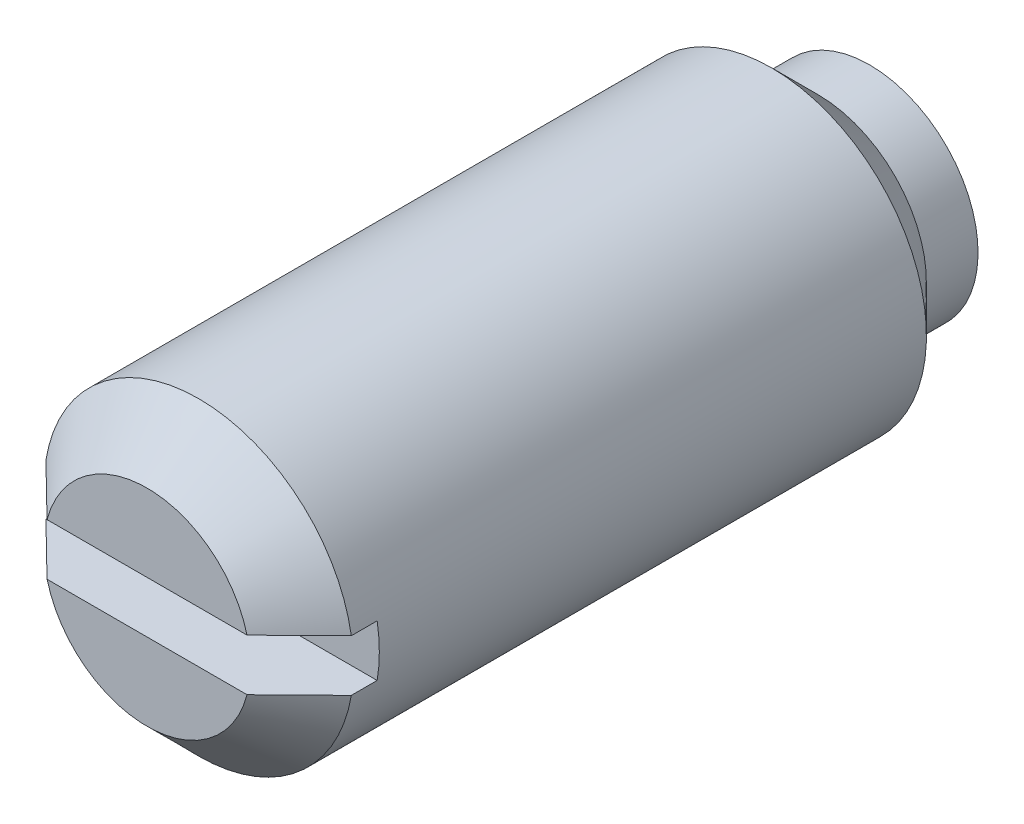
ISO-10303-21;
HEADER;
FILE_DESCRIPTION(('STEP AP214'),'2;1');
FILE_NAME('part.step','',(''),(''),'','','');
FILE_SCHEMA(('AUTOMOTIVE_DESIGN { 1 0 10303 214 1 1 1 1 }'));
ENDSEC;
DATA;
#1=APPLICATION_CONTEXT('core data for automotive mechanical design processes');
#2=APPLICATION_PROTOCOL_DEFINITION('international standard','automotive_design',2000,#1);
#3=PRODUCT_CONTEXT('',#1,'mechanical');
#4=PRODUCT('Part','Part','',(#3));
#5=PRODUCT_RELATED_PRODUCT_CATEGORY('part','',(#4));
#6=PRODUCT_DEFINITION_FORMATION('','',#4);
#7=PRODUCT_DEFINITION_CONTEXT('part definition',#1,'design');
#8=PRODUCT_DEFINITION('design','',#6,#7);
#9=PRODUCT_DEFINITION_SHAPE('','',#8);
#10=(LENGTH_UNIT() NAMED_UNIT(*) SI_UNIT(.MILLI.,.METRE.));
#11=(NAMED_UNIT(*) PLANE_ANGLE_UNIT() SI_UNIT($,.RADIAN.));
#12=(NAMED_UNIT(*) SI_UNIT($,.STERADIAN.) SOLID_ANGLE_UNIT());
#13=UNCERTAINTY_MEASURE_WITH_UNIT(LENGTH_MEASURE(1.E-05),#10,'distance_accuracy_value','');
#14=(GEOMETRIC_REPRESENTATION_CONTEXT(3) GLOBAL_UNCERTAINTY_ASSIGNED_CONTEXT((#13)) GLOBAL_UNIT_ASSIGNED_CONTEXT((#10,
#11,#12)) REPRESENTATION_CONTEXT('',''));
#15=CARTESIAN_POINT('',(0.,0.,0.));
#16=DIRECTION('',(0.,0.,1.));
#17=DIRECTION('',(1.,0.,0.));
#18=AXIS2_PLACEMENT_3D('',#15,#16,#17);
#19=CARTESIAN_POINT('',(0.,3.,15.));
#20=DIRECTION('',(0.,0.,1.));
#21=DIRECTION('',(1.,0.,0.));
#22=AXIS2_PLACEMENT_3D('',#19,#20,#21);
#23=PLANE('',#22);
#24=CARTESIAN_POINT('',(0.,0.,15.));
#25=DIRECTION('',(0.,0.,-1.));
#26=DIRECTION('',(0.,1.,0.));
#27=AXIS2_PLACEMENT_3D('',#24,#25,#26);
#28=CIRCLE('',#27,2.);
#29=CARTESIAN_POINT('',(-1.93649167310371,0.5,15.));
#30=VERTEX_POINT('',#29);
#31=CARTESIAN_POINT('',(1.9364916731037,0.5,15.));
#32=VERTEX_POINT('',#31);
#33=EDGE_CURVE('E35',#30,#32,#28,.T.);
#34=ORIENTED_EDGE('',*,*,#33,.F.);
#35=DIRECTION('',(1.,0.,0.));
#36=VECTOR('',#35,1.);
#37=CARTESIAN_POINT('',(-2.95803989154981,0.5,15.));
#38=LINE('',#37,#36);
#39=EDGE_CURVE('E124',#30,#32,#38,.T.);
#40=ORIENTED_EDGE('',*,*,#39,.T.);
#41=EDGE_LOOP('',(#34,#40));
#42=FACE_BOUND('',#41,.T.);
#43=ADVANCED_FACE('F14',(#42),#23,.T.);
#44=CARTESIAN_POINT('',(0.,0.,-5.));
#45=DIRECTION('',(0.,0.,-1.));
#46=DIRECTION('',(-1.,0.,0.));
#47=AXIS2_PLACEMENT_3D('',#44,#45,#46);
#48=CYLINDRICAL_SURFACE('',#47,3.);
#49=CARTESIAN_POINT('',(0.,0.,14.));
#50=DIRECTION('',(0.,0.,-1.));
#51=DIRECTION('',(0.,1.,0.));
#52=AXIS2_PLACEMENT_3D('',#49,#50,#51);
#53=CIRCLE('',#52,3.);
#54=CARTESIAN_POINT('',(2.95803989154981,-0.5,14.));
#55=VERTEX_POINT('',#54);
#56=CARTESIAN_POINT('',(-2.95803989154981,-0.5,14.));
#57=VERTEX_POINT('',#56);
#58=EDGE_CURVE('E43',#55,#57,#53,.T.);
#59=ORIENTED_EDGE('',*,*,#58,.T.);
#60=DIRECTION('',(0.,0.,1.));
#61=VECTOR('',#60,1.);
#62=CARTESIAN_POINT('',(-2.95803989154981,-0.5,13.5));
#63=LINE('',#62,#61);
#64=CARTESIAN_POINT('',(-2.95803989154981,-0.5,13.5));
#65=VERTEX_POINT('',#64);
#66=EDGE_CURVE('E101',#65,#57,#63,.T.);
#67=ORIENTED_EDGE('',*,*,#66,.F.);
#68=CARTESIAN_POINT('',(0.,0.,13.5));
#69=DIRECTION('',(0.,0.,1.));
#70=DIRECTION('',(1.,0.,0.));
#71=AXIS2_PLACEMENT_3D('',#68,#69,#70);
#72=CIRCLE('',#71,3.);
#73=CARTESIAN_POINT('',(-2.95803989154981,0.5,13.5));
#74=VERTEX_POINT('',#73);
#75=EDGE_CURVE('E121',#74,#65,#72,.T.);
#76=ORIENTED_EDGE('',*,*,#75,.F.);
#77=DIRECTION('',(0.,0.,1.));
#78=VECTOR('',#77,1.);
#79=CARTESIAN_POINT('',(-2.95803989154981,0.5,13.5));
#80=LINE('',#79,#78);
#81=CARTESIAN_POINT('',(-2.95803989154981,0.5,14.));
#82=VERTEX_POINT('',#81);
#83=EDGE_CURVE('E90',#74,#82,#80,.T.);
#84=ORIENTED_EDGE('',*,*,#83,.T.);
#85=CARTESIAN_POINT('',(2.95803989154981,0.5,14.));
#86=VERTEX_POINT('',#85);
#87=EDGE_CURVE('E73',#82,#86,#53,.T.);
#88=ORIENTED_EDGE('',*,*,#87,.T.);
#89=DIRECTION('',(0.,0.,1.));
#90=VECTOR('',#89,1.);
#91=CARTESIAN_POINT('',(2.95803989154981,0.5,13.5));
#92=LINE('',#91,#90);
#93=CARTESIAN_POINT('',(2.95803989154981,0.5,13.5));
#94=VERTEX_POINT('',#93);
#95=EDGE_CURVE('E88',#94,#86,#92,.T.);
#96=ORIENTED_EDGE('',*,*,#95,.F.);
#97=CARTESIAN_POINT('',(2.95803989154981,-0.5,13.5));
#98=VERTEX_POINT('',#97);
#99=EDGE_CURVE('E117',#98,#94,#72,.T.);
#100=ORIENTED_EDGE('',*,*,#99,.F.);
#101=DIRECTION('',(0.,0.,1.));
#102=VECTOR('',#101,1.);
#103=CARTESIAN_POINT('',(2.95803989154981,-0.5,13.5));
#104=LINE('',#103,#102);
#105=EDGE_CURVE('E96',#98,#55,#104,.T.);
#106=ORIENTED_EDGE('',*,*,#105,.T.);
#107=EDGE_LOOP('',(#59,#67,#76,#84,#88,#96,#100,#106));
#108=FACE_BOUND('',#107,.T.);
#109=CARTESIAN_POINT('',(0.,0.,2.9));
#110=DIRECTION('',(0.,0.,-1.));
#111=DIRECTION('',(0.,1.,0.));
#112=AXIS2_PLACEMENT_3D('',#109,#110,#111);
#113=CIRCLE('',#112,3.);
#114=CARTESIAN_POINT('',(0.,3.,2.9));
#115=VERTEX_POINT('',#114);
#116=EDGE_CURVE('E135',#115,#115,#113,.T.);
#117=ORIENTED_EDGE('',*,*,#116,.F.);
#118=EDGE_LOOP('',(#117));
#119=FACE_BOUND('',#118,.T.);
#120=ADVANCED_FACE('F85',(#108,#119),#48,.T.);
#121=CARTESIAN_POINT('',(1.93649167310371,-0.5,15.));
#122=VERTEX_POINT('',#121);
#123=CARTESIAN_POINT('',(-1.93649167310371,-0.5,15.));
#124=VERTEX_POINT('',#123);
#125=EDGE_CURVE('E80',#122,#124,#28,.T.);
#126=ORIENTED_EDGE('',*,*,#125,.F.);
#127=DIRECTION('',(1.,0.,0.));
#128=VECTOR('',#127,1.);
#129=CARTESIAN_POINT('',(-2.95803989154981,-0.5,15.));
#130=LINE('',#129,#128);
#131=EDGE_CURVE('E114',#124,#122,#130,.T.);
#132=ORIENTED_EDGE('',*,*,#131,.F.);
#133=EDGE_LOOP('',(#126,#132));
#134=FACE_BOUND('',#133,.T.);
#135=ADVANCED_FACE('F167',(#134),#23,.T.);
#136=CARTESIAN_POINT('',(-2.95803989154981,0.5,13.5));
#137=DIRECTION('',(0.,-1.,0.));
#138=DIRECTION('',(1.,0.,0.));
#139=AXIS2_PLACEMENT_3D('',#136,#137,#138);
#140=PLANE('',#139);
#141=CARTESIAN_POINT('',(-6.55823989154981,0.5,10.422727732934));
#142=CARTESIAN_POINT('',(-6.3258505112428,0.5,10.6544387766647));
#143=CARTESIAN_POINT('',(-6.09343107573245,0.5,10.8861197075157));
#144=CARTESIAN_POINT('',(-5.62848265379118,0.5,11.3493887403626));
#145=CARTESIAN_POINT('',(-5.3959536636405,0.5,11.5809768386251));
#146=CARTESIAN_POINT('',(-4.93054549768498,0.5,12.0442178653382));
#147=CARTESIAN_POINT('',(-4.69766619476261,0.5,12.2758706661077));
#148=CARTESIAN_POINT('',(-4.23169594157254,0.5,12.7389466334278));
#149=CARTESIAN_POINT('',(-3.99860499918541,0.5,12.9703698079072));
#150=CARTESIAN_POINT('',(-3.54237472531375,0.5,13.4226350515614));
#151=CARTESIAN_POINT('',(-3.31925087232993,0.5,13.6434927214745));
#152=CARTESIAN_POINT('',(-2.98410995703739,0.5,13.9743426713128));
#153=CARTESIAN_POINT('',(-2.87231436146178,0.5,14.084559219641));
#154=CARTESIAN_POINT('',(-2.6485138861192,0.5,14.3047773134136));
#155=CARTESIAN_POINT('',(-2.53650900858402,0.5,14.4147788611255));
#156=CARTESIAN_POINT('',(-2.31225573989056,0.5,14.6344111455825));
#157=CARTESIAN_POINT('',(-2.20000751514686,0.5,14.7440420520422));
#158=CARTESIAN_POINT('',(-1.97503630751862,0.5,14.962824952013));
#159=CARTESIAN_POINT('',(-1.86231330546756,0.5,15.0719769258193));
#160=CARTESIAN_POINT('',(-1.63612484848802,0.5,15.2894698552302));
#161=CARTESIAN_POINT('',(-1.52265953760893,0.5,15.3978109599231));
#162=CARTESIAN_POINT('',(-1.35140111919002,0.5,15.5591909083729));
#163=CARTESIAN_POINT('',(-1.29414015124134,0.5,15.6127938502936));
#164=CARTESIAN_POINT('',(-1.17910548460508,0.5,15.7194460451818));
#165=CARTESIAN_POINT('',(-1.12133179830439,0.5,15.7724953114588));
#166=CARTESIAN_POINT('',(-1.03086879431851,0.5,15.8543543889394));
#167=CARTESIAN_POINT('',(-0.998444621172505,0.5,15.8834569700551));
#168=CARTESIAN_POINT('',(-0.933287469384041,0.5,15.9413214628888));
#169=CARTESIAN_POINT('',(-0.900554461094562,0.5,15.9700833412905));
#170=CARTESIAN_POINT('',(-0.834453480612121,0.5,16.027355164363));
#171=CARTESIAN_POINT('',(-0.8010826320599,0.5,16.0558617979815));
#172=CARTESIAN_POINT('',(-0.733810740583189,0.5,16.1122272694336));
#173=CARTESIAN_POINT('',(-0.699909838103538,0.5,16.1400862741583));
#174=CARTESIAN_POINT('',(-0.631088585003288,0.5,16.1951144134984));
#175=CARTESIAN_POINT('',(-0.596162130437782,0.5,16.222275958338));
#176=CARTESIAN_POINT('',(-0.525263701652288,0.5,16.2751942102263));
#177=CARTESIAN_POINT('',(-0.489292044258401,0.5,16.3009513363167));
#178=CARTESIAN_POINT('',(-0.416053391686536,0.5,16.3501044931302));
#179=CARTESIAN_POINT('',(-0.37879516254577,0.5,16.3735134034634));
#180=CARTESIAN_POINT('',(-0.302224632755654,0.5,16.4166155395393));
#181=CARTESIAN_POINT('',(-0.26291823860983,0.5,16.4363187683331));
#182=CARTESIAN_POINT('',(-0.191729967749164,0.5,16.4652209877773));
#183=CARTESIAN_POINT('',(-0.160435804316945,0.5,16.4758138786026));
#184=CARTESIAN_POINT('',(-0.0965954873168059,0.5,16.491681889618));
#185=CARTESIAN_POINT('',(-0.0640558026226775,0.5,16.496981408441));
#186=CARTESIAN_POINT('',(0.00176048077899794,0.5,16.5010801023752));
#187=CARTESIAN_POINT('',(0.0350410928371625,0.5,16.4998195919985));
#188=CARTESIAN_POINT('',(0.100807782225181,0.5,16.4909951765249));
#189=CARTESIAN_POINT('',(0.133290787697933,0.5,16.4834099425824));
#190=CARTESIAN_POINT('',(0.189117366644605,0.5,16.4659246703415));
#191=CARTESIAN_POINT('',(0.212790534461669,0.5,16.4570104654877));
#192=CARTESIAN_POINT('',(0.259284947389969,0.5,16.4371616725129));
#193=CARTESIAN_POINT('',(0.282105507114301,0.5,16.4262254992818));
#194=CARTESIAN_POINT('',(0.327074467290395,0.5,16.4028346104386));
#195=CARTESIAN_POINT('',(0.349219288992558,0.5,16.3903731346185));
#196=CARTESIAN_POINT('',(0.392846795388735,0.5,16.3643710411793));
#197=CARTESIAN_POINT('',(0.41432975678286,0.5,16.3508308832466));
#198=CARTESIAN_POINT('',(0.486234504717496,0.5,16.3036205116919));
#199=CARTESIAN_POINT('',(0.53543138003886,0.5,16.2680978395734));
#200=CARTESIAN_POINT('',(0.632046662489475,0.5,16.194695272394));
#201=CARTESIAN_POINT('',(0.679463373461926,0.5,16.1568132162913));
#202=CARTESIAN_POINT('',(0.77325635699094,0.5,16.0795556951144));
#203=CARTESIAN_POINT('',(0.819629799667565,0.5,16.0401768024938));
#204=CARTESIAN_POINT('',(0.91158361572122,0.5,15.9605483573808));
#205=CARTESIAN_POINT('',(0.957164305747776,0.5,15.9202991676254));
#206=CARTESIAN_POINT('',(1.0478757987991,0.5,15.8391237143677));
#207=CARTESIAN_POINT('',(1.09300556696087,0.5,15.798196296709));
#208=CARTESIAN_POINT('',(1.1828798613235,0.5,15.7159126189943));
#209=CARTESIAN_POINT('',(1.22762434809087,0.5,15.6745563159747));
#210=CARTESIAN_POINT('',(1.36129129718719,0.5,15.5501584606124));
#211=CARTESIAN_POINT('',(1.44978831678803,0.5,15.466660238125));
#212=CARTESIAN_POINT('',(1.62529993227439,0.5,15.2997399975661));
#213=CARTESIAN_POINT('',(1.71232066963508,0.5,15.2163244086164));
#214=CARTESIAN_POINT('',(1.88593420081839,0.5,15.0490486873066));
#215=CARTESIAN_POINT('',(1.97252699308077,0.5,14.9651885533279));
#216=CARTESIAN_POINT('',(2.231884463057,0.5,14.7131640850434));
#217=CARTESIAN_POINT('',(2.40422250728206,0.5,14.5445611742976));
#218=CARTESIAN_POINT('',(2.7484192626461,0.5,14.2066563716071));
#219=CARTESIAN_POINT('',(2.9202776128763,0.5,14.0373541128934));
#220=CARTESIAN_POINT('',(3.26363960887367,0.5,13.698395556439));
#221=CARTESIAN_POINT('',(3.43514325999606,0.5,13.5287392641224));
#222=CARTESIAN_POINT('',(3.77752405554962,0.5,13.189600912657));
#223=CARTESIAN_POINT('',(3.94840172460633,0.5,13.0201193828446));
#224=CARTESIAN_POINT('',(4.29000633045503,0.5,12.6810031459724));
#225=CARTESIAN_POINT('',(4.46073326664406,0.5,12.5113684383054));
#226=CARTESIAN_POINT('',(4.97270275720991,0.5,12.0023591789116));
#227=CARTESIAN_POINT('',(5.31378775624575,0.5,11.6628261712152));
#228=CARTESIAN_POINT('',(5.73004088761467,0.5,11.2481891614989));
#229=CARTESIAN_POINT('',(5.80531736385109,0.5,11.1731938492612));
#230=CARTESIAN_POINT('',(5.9558616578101,0.5,11.0231909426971));
#231=CARTESIAN_POINT('',(6.03112947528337,0.5,10.9481833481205));
#232=CARTESIAN_POINT('',(6.18171007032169,0.5,10.7981049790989));
#233=CARTESIAN_POINT('',(6.25702284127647,0.5,10.7230341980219));
#234=CARTESIAN_POINT('',(6.40763827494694,0.5,10.5728860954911));
#235=CARTESIAN_POINT('',(6.48294093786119,0.5,10.4978087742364));
#236=CARTESIAN_POINT('',(6.55823989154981,0.5,10.422727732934));
#237=B_SPLINE_CURVE_WITH_KNOTS('',3,(#141,#142,#143,#144,#145,#146,#147,#148,#149,#150,#151,
#152,#153,#154,#155,#156,#157,#158,#159,#160,#161,#162,#163,#164,#165,#166,#167,#168,#169,#170,
#171,#172,#173,#174,#175,#176,#177,#178,#179,#180,#181,#182,#183,#184,#185,#186,#187,#188,#189,
#190,#191,#192,#193,#194,#195,#196,#197,#198,#199,#200,#201,#202,#203,#204,#205,#206,#207,#208,
#209,#210,#211,#212,#213,#214,#215,#216,#217,#218,#219,#220,#221,#222,#223,#224,#225,#226,#227,
#228,#229,#230,#231,#232,#233,#234,#235,#236),.UNSPECIFIED.,.F.,.F.,(4,2,2,2,2,2,2,2,2,2,2,2,2,
2,2,2,2,2,2,2,2,2,2,2,2,2,2,2,2,2,2,2,2,2,2,2,2,2,2,2,2,2,2,2,2,2,2,4),(0.,0.984506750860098,
1.96904976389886,2.95447449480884,3.93986392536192,4.88170248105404,5.35267306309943,
5.82363865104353,6.29434700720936,6.76507455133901,7.23571330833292,7.47101710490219,
7.70631523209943,7.83702148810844,7.96774042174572,8.09940173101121,8.23102872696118,
8.36374189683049,8.49641524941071,8.62831576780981,8.75985495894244,8.85864757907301,
8.9569827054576,9.05621407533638,9.15578144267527,9.23156362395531,9.3074054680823,
9.3835965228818,9.45975528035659,9.64163263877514,9.82367910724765,10.0061710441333,
10.1885883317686,10.371356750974,10.5541436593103,10.9191466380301,11.2807759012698,
11.642406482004,12.3656914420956,13.089422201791,13.8131419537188,14.5351588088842,
15.2571785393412,16.7009908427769,17.0197660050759,17.3385487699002,17.6575608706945,
17.9765653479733),.UNSPECIFIED.);
#238=EDGE_CURVE('E79',#82,#30,#237,.T.);
#239=ORIENTED_EDGE('',*,*,#238,.F.);
#240=ORIENTED_EDGE('',*,*,#83,.F.);
#241=DIRECTION('',(1.,0.,0.));
#242=VECTOR('',#241,1.);
#243=CARTESIAN_POINT('',(-2.95803989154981,0.5,13.5));
#244=LINE('',#243,#242);
#245=EDGE_CURVE('E95',#74,#94,#244,.T.);
#246=ORIENTED_EDGE('',*,*,#245,.T.);
#247=ORIENTED_EDGE('',*,*,#95,.T.);
#248=EDGE_CURVE('E70',#32,#86,#237,.T.);
#249=ORIENTED_EDGE('',*,*,#248,.F.);
#250=ORIENTED_EDGE('',*,*,#39,.F.);
#251=EDGE_LOOP('',(#239,#240,#246,#247,#249,#250));
#252=FACE_BOUND('',#251,.T.);
#253=ADVANCED_FACE('F93',(#252),#140,.T.);
#254=CARTESIAN_POINT('',(-2.95803989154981,-0.5,13.5));
#255=DIRECTION('',(0.,-1.,0.));
#256=DIRECTION('',(1.,0.,0.));
#257=AXIS2_PLACEMENT_3D('',#254,#255,#256);
#258=PLANE('',#257);
#259=ORIENTED_EDGE('',*,*,#66,.T.);
#260=CARTESIAN_POINT('',(-6.55823989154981,-0.5,10.422727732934));
#261=CARTESIAN_POINT('',(-6.3258505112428,-0.5,10.6544387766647));
#262=CARTESIAN_POINT('',(-6.09343107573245,-0.5,10.8861197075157));
#263=CARTESIAN_POINT('',(-5.62848265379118,-0.5,11.3493887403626));
#264=CARTESIAN_POINT('',(-5.3959536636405,-0.5,11.5809768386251));
#265=CARTESIAN_POINT('',(-4.93054549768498,-0.5,12.0442178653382));
#266=CARTESIAN_POINT('',(-4.69766619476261,-0.5,12.2758706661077));
#267=CARTESIAN_POINT('',(-4.23169594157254,-0.5,12.7389466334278));
#268=CARTESIAN_POINT('',(-3.99860499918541,-0.5,12.9703698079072));
#269=CARTESIAN_POINT('',(-3.54237472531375,-0.5,13.4226350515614));
#270=CARTESIAN_POINT('',(-3.31925087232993,-0.5,13.6434927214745));
#271=CARTESIAN_POINT('',(-2.9841099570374,-0.5,13.9743426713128));
#272=CARTESIAN_POINT('',(-2.87231436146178,-0.5,14.084559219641));
#273=CARTESIAN_POINT('',(-2.6485138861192,-0.5,14.3047773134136));
#274=CARTESIAN_POINT('',(-2.53650900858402,-0.5,14.4147788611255));
#275=CARTESIAN_POINT('',(-2.31225573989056,-0.5,14.6344111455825));
#276=CARTESIAN_POINT('',(-2.20000751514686,-0.5,14.7440420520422));
#277=CARTESIAN_POINT('',(-1.97503630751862,-0.5,14.962824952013));
#278=CARTESIAN_POINT('',(-1.86231330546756,-0.5,15.0719769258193));
#279=CARTESIAN_POINT('',(-1.63612484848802,-0.5,15.2894698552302));
#280=CARTESIAN_POINT('',(-1.52265953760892,-0.5,15.3978109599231));
#281=CARTESIAN_POINT('',(-1.35140111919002,-0.5,15.5591909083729));
#282=CARTESIAN_POINT('',(-1.29414015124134,-0.5,15.6127938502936));
#283=CARTESIAN_POINT('',(-1.17910548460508,-0.5,15.7194460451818));
#284=CARTESIAN_POINT('',(-1.12133179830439,-0.5,15.7724953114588));
#285=CARTESIAN_POINT('',(-1.03086879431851,-0.5,15.8543543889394));
#286=CARTESIAN_POINT('',(-0.998444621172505,-0.5,15.8834569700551));
#287=CARTESIAN_POINT('',(-0.933287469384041,-0.5,15.9413214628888));
#288=CARTESIAN_POINT('',(-0.900554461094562,-0.5,15.9700833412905));
#289=CARTESIAN_POINT('',(-0.834453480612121,-0.5,16.027355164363));
#290=CARTESIAN_POINT('',(-0.8010826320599,-0.5,16.0558617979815));
#291=CARTESIAN_POINT('',(-0.733810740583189,-0.5,16.1122272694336));
#292=CARTESIAN_POINT('',(-0.699909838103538,-0.5,16.1400862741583));
#293=CARTESIAN_POINT('',(-0.631088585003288,-0.5,16.1951144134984));
#294=CARTESIAN_POINT('',(-0.596162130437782,-0.5,16.222275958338));
#295=CARTESIAN_POINT('',(-0.525263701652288,-0.5,16.2751942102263));
#296=CARTESIAN_POINT('',(-0.489292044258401,-0.5,16.3009513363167));
#297=CARTESIAN_POINT('',(-0.416053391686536,-0.5,16.3501044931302));
#298=CARTESIAN_POINT('',(-0.37879516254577,-0.5,16.3735134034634));
#299=CARTESIAN_POINT('',(-0.302224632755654,-0.5,16.4166155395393));
#300=CARTESIAN_POINT('',(-0.262918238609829,-0.5,16.4363187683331));
#301=CARTESIAN_POINT('',(-0.191729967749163,-0.5,16.4652209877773));
#302=CARTESIAN_POINT('',(-0.160435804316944,-0.5,16.4758138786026));
#303=CARTESIAN_POINT('',(-0.0965954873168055,-0.5,16.491681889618));
#304=CARTESIAN_POINT('',(-0.064055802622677,-0.5,16.496981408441));
#305=CARTESIAN_POINT('',(0.00176048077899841,-0.5,16.5010801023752));
#306=CARTESIAN_POINT('',(0.035041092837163,-0.5,16.4998195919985));
#307=CARTESIAN_POINT('',(0.100807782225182,-0.5,16.4909951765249));
#308=CARTESIAN_POINT('',(0.133290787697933,-0.5,16.4834099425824));
#309=CARTESIAN_POINT('',(0.189117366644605,-0.5,16.4659246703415));
#310=CARTESIAN_POINT('',(0.212790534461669,-0.5,16.4570104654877));
#311=CARTESIAN_POINT('',(0.259284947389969,-0.5,16.4371616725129));
#312=CARTESIAN_POINT('',(0.282105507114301,-0.5,16.4262254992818));
#313=CARTESIAN_POINT('',(0.327074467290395,-0.5,16.4028346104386));
#314=CARTESIAN_POINT('',(0.349219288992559,-0.5,16.3903731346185));
#315=CARTESIAN_POINT('',(0.392846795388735,-0.5,16.3643710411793));
#316=CARTESIAN_POINT('',(0.41432975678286,-0.5,16.3508308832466));
#317=CARTESIAN_POINT('',(0.486234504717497,-0.5,16.3036205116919));
#318=CARTESIAN_POINT('',(0.535431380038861,-0.5,16.2680978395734));
#319=CARTESIAN_POINT('',(0.632046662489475,-0.5,16.194695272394));
#320=CARTESIAN_POINT('',(0.679463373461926,-0.5,16.1568132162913));
#321=CARTESIAN_POINT('',(0.773256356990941,-0.5,16.0795556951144));
#322=CARTESIAN_POINT('',(0.819629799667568,-0.5,16.0401768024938));
#323=CARTESIAN_POINT('',(0.911583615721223,-0.5,15.9605483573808));
#324=CARTESIAN_POINT('',(0.957164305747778,-0.5,15.9202991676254));
#325=CARTESIAN_POINT('',(1.0478757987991,-0.5,15.8391237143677));
#326=CARTESIAN_POINT('',(1.09300556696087,-0.5,15.798196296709));
#327=CARTESIAN_POINT('',(1.1828798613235,-0.5,15.7159126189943));
#328=CARTESIAN_POINT('',(1.22762434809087,-0.5,15.6745563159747));
#329=CARTESIAN_POINT('',(1.36129129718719,-0.5,15.5501584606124));
#330=CARTESIAN_POINT('',(1.44978831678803,-0.5,15.466660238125));
#331=CARTESIAN_POINT('',(1.62529993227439,-0.5,15.2997399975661));
#332=CARTESIAN_POINT('',(1.71232066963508,-0.5,15.2163244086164));
#333=CARTESIAN_POINT('',(1.88593420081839,-0.5,15.0490486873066));
#334=CARTESIAN_POINT('',(1.97252699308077,-0.5,14.9651885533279));
#335=CARTESIAN_POINT('',(2.231884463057,-0.5,14.7131640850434));
#336=CARTESIAN_POINT('',(2.40422250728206,-0.5,14.5445611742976));
#337=CARTESIAN_POINT('',(2.7484192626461,-0.5,14.2066563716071));
#338=CARTESIAN_POINT('',(2.9202776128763,-0.5,14.0373541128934));
#339=CARTESIAN_POINT('',(3.26363960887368,-0.5,13.698395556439));
#340=CARTESIAN_POINT('',(3.43514325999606,-0.5,13.5287392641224));
#341=CARTESIAN_POINT('',(3.77752405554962,-0.5,13.189600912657));
#342=CARTESIAN_POINT('',(3.94840172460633,-0.5,13.0201193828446));
#343=CARTESIAN_POINT('',(4.29000633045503,-0.5,12.6810031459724));
#344=CARTESIAN_POINT('',(4.46073326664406,-0.5,12.5113684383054));
#345=CARTESIAN_POINT('',(4.97270275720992,-0.5,12.0023591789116));
#346=CARTESIAN_POINT('',(5.31378775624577,-0.5,11.6628261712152));
#347=CARTESIAN_POINT('',(5.73004088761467,-0.5,11.2481891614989));
#348=CARTESIAN_POINT('',(5.80531736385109,-0.5,11.1731938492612));
#349=CARTESIAN_POINT('',(5.9558616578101,-0.5,11.0231909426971));
#350=CARTESIAN_POINT('',(6.03112947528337,-0.5,10.9481833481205));
#351=CARTESIAN_POINT('',(6.18171007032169,-0.5,10.7981049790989));
#352=CARTESIAN_POINT('',(6.25702284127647,-0.5,10.7230341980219));
#353=CARTESIAN_POINT('',(6.40763827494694,-0.5,10.5728860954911));
#354=CARTESIAN_POINT('',(6.48294093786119,-0.5,10.4978087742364));
#355=CARTESIAN_POINT('',(6.55823989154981,-0.5,10.422727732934));
#356=B_SPLINE_CURVE_WITH_KNOTS('',3,(#260,#261,#262,#263,#264,#265,#266,#267,#268,#269,#270,
#271,#272,#273,#274,#275,#276,#277,#278,#279,#280,#281,#282,#283,#284,#285,#286,#287,#288,#289,
#290,#291,#292,#293,#294,#295,#296,#297,#298,#299,#300,#301,#302,#303,#304,#305,#306,#307,#308,
#309,#310,#311,#312,#313,#314,#315,#316,#317,#318,#319,#320,#321,#322,#323,#324,#325,#326,#327,
#328,#329,#330,#331,#332,#333,#334,#335,#336,#337,#338,#339,#340,#341,#342,#343,#344,#345,#346,
#347,#348,#349,#350,#351,#352,#353,#354,#355),.UNSPECIFIED.,.F.,.F.,(4,2,2,2,2,2,2,2,2,2,2,2,2,
2,2,2,2,2,2,2,2,2,2,2,2,2,2,2,2,2,2,2,2,2,2,2,2,2,2,2,2,2,2,2,2,2,2,4),(0.,0.984506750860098,
1.96904976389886,2.95447449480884,3.93986392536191,4.88170248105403,5.35267306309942,
5.82363865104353,6.29434700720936,6.76507455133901,7.23571330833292,7.47101710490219,
7.70631523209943,7.83702148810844,7.96774042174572,8.09940173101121,8.23102872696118,
8.36374189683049,8.49641524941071,8.62831576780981,8.75985495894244,8.85864757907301,
8.9569827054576,9.05621407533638,9.15578144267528,9.23156362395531,9.3074054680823,
9.3835965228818,9.45975528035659,9.64163263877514,9.82367910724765,10.0061710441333,
10.1885883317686,10.371356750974,10.5541436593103,10.9191466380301,11.2807759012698,
11.642406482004,12.3656914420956,13.089422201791,13.8131419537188,14.5351588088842,
15.2571785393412,16.7009908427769,17.0197660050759,17.3385487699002,17.6575608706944,
17.9765653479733),.UNSPECIFIED.);
#357=EDGE_CURVE('E9',#57,#124,#356,.T.);
#358=ORIENTED_EDGE('',*,*,#357,.T.);
#359=ORIENTED_EDGE('',*,*,#131,.T.);
#360=EDGE_CURVE('E18',#122,#55,#356,.T.);
#361=ORIENTED_EDGE('',*,*,#360,.T.);
#362=ORIENTED_EDGE('',*,*,#105,.F.);
#363=DIRECTION('',(1.,0.,0.));
#364=VECTOR('',#363,1.);
#365=CARTESIAN_POINT('',(-2.95803989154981,-0.5,13.5));
#366=LINE('',#365,#364);
#367=EDGE_CURVE('E119',#65,#98,#366,.T.);
#368=ORIENTED_EDGE('',*,*,#367,.F.);
#369=EDGE_LOOP('',(#259,#358,#359,#361,#362,#368));
#370=FACE_BOUND('',#369,.T.);
#371=ADVANCED_FACE('F111',(#370),#258,.F.);
#372=CARTESIAN_POINT('',(0.,0.,13.5));
#373=DIRECTION('',(0.,0.,1.));
#374=DIRECTION('',(1.,0.,0.));
#375=AXIS2_PLACEMENT_3D('',#372,#373,#374);
#376=PLANE('',#375);
#377=ORIENTED_EDGE('',*,*,#75,.T.);
#378=ORIENTED_EDGE('',*,*,#367,.T.);
#379=ORIENTED_EDGE('',*,*,#99,.T.);
#380=ORIENTED_EDGE('',*,*,#245,.F.);
#381=EDGE_LOOP('',(#377,#378,#379,#380));
#382=FACE_BOUND('',#381,.T.);
#383=ADVANCED_FACE('F157',(#382),#376,.T.);
#384=CARTESIAN_POINT('',(0.,0.,-0.732154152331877));
#385=DIRECTION('',(0.,0.,-1.));
#386=DIRECTION('',(0.,1.,0.));
#387=AXIS2_PLACEMENT_3D('',#384,#385,#386);
#388=CYLINDRICAL_SURFACE('',#387,2.1);
#389=CARTESIAN_POINT('',(0.,0.,1.));
#390=DIRECTION('',(0.,0.,-1.));
#391=DIRECTION('',(0.,1.,0.));
#392=AXIS2_PLACEMENT_3D('',#389,#390,#391);
#393=CIRCLE('',#392,2.1);
#394=CARTESIAN_POINT('',(0.,2.1,1.));
#395=VERTEX_POINT('',#394);
#396=EDGE_CURVE('E127',#395,#395,#393,.T.);
#397=ORIENTED_EDGE('',*,*,#396,.F.);
#398=EDGE_LOOP('',(#397));
#399=FACE_BOUND('',#398,.T.);
#400=CARTESIAN_POINT('',(0.,0.,2.));
#401=DIRECTION('',(0.,0.,-1.));
#402=DIRECTION('',(0.,1.,0.));
#403=AXIS2_PLACEMENT_3D('',#400,#401,#402);
#404=CIRCLE('',#403,2.1);
#405=CARTESIAN_POINT('',(0.,2.1,2.));
#406=VERTEX_POINT('',#405);
#407=EDGE_CURVE('E132',#406,#406,#404,.T.);
#408=ORIENTED_EDGE('',*,*,#407,.T.);
#409=EDGE_LOOP('',(#408));
#410=FACE_BOUND('',#409,.T.);
#411=ADVANCED_FACE('F153',(#399,#410),#388,.T.);
#412=CARTESIAN_POINT('',(0.,0.,2.9));
#413=DIRECTION('',(0.,0.,1.));
#414=DIRECTION('',(0.,-1.,0.));
#415=AXIS2_PLACEMENT_3D('',#412,#413,#414);
#416=CONICAL_SURFACE('',#415,3.,0.785398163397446);
#417=ORIENTED_EDGE('',*,*,#407,.F.);
#418=EDGE_LOOP('',(#417));
#419=FACE_BOUND('',#418,.T.);
#420=ORIENTED_EDGE('',*,*,#116,.T.);
#421=EDGE_LOOP('',(#420));
#422=FACE_BOUND('',#421,.T.);
#423=ADVANCED_FACE('F149',(#419,#422),#416,.T.);
#424=CARTESIAN_POINT('',(0.,0.,1.75));
#425=DIRECTION('',(-1.,0.,0.));
#426=DIRECTION('',(0.,0.,1.));
#427=AXIS2_PLACEMENT_3D('',#424,#425,#426);
#428=SPHERICAL_SURFACE('',#427,1.75);
#429=CARTESIAN_POINT('',(0.,0.,1.75));
#430=DIRECTION('',(0.,0.,-1.));
#431=DIRECTION('',(-1.,0.,0.));
#432=AXIS2_PLACEMENT_3D('',#429,#430,#431);
#433=SPHERICAL_SURFACE('',#432,1.75);
#434=CARTESIAN_POINT('',(0.,0.,1.));
#435=DIRECTION('',(0.,0.,-1.));
#436=DIRECTION('',(-1.,0.,0.));
#437=AXIS2_PLACEMENT_3D('',#434,#435,#436);
#438=CIRCLE('',#437,1.58113883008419);
#439=CARTESIAN_POINT('',(-1.58113883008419,0.,1.));
#440=VERTEX_POINT('',#439);
#441=EDGE_CURVE('E98',#440,#440,#438,.T.);
#442=ORIENTED_EDGE('',*,*,#441,.T.);
#443=EDGE_LOOP('',(#442));
#444=FACE_BOUND('',#443,.T.);
#445=ADVANCED_FACE('F16',(#444),#433,.T.);
#446=CARTESIAN_POINT('',(0.,1.58113883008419,1.));
#447=DIRECTION('',(0.,0.,-1.));
#448=DIRECTION('',(-1.,0.,0.));
#449=AXIS2_PLACEMENT_3D('',#446,#447,#448);
#450=PLANE('',#449);
#451=ORIENTED_EDGE('',*,*,#396,.T.);
#452=EDGE_LOOP('',(#451));
#453=FACE_BOUND('',#452,.T.);
#454=ORIENTED_EDGE('',*,*,#441,.F.);
#455=EDGE_LOOP('',(#454));
#456=FACE_BOUND('',#455,.T.);
#457=ADVANCED_FACE('F180',(#453,#456),#450,.T.);
#458=CARTESIAN_POINT('',(0.,0.,15.));
#459=DIRECTION('',(0.,0.,-1.));
#460=DIRECTION('',(0.,1.,0.));
#461=AXIS2_PLACEMENT_3D('',#458,#459,#460);
#462=CONICAL_SURFACE('',#461,2.,0.785398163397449);
#463=ORIENTED_EDGE('',*,*,#58,.F.);
#464=ORIENTED_EDGE('',*,*,#360,.F.);
#465=ORIENTED_EDGE('',*,*,#125,.T.);
#466=ORIENTED_EDGE('',*,*,#357,.F.);
#467=EDGE_LOOP('',(#463,#464,#465,#466));
#468=FACE_BOUND('',#467,.T.);
#469=ADVANCED_FACE('F148',(#468),#462,.T.);
#470=ORIENTED_EDGE('',*,*,#238,.T.);
#471=ORIENTED_EDGE('',*,*,#33,.T.);
#472=ORIENTED_EDGE('',*,*,#248,.T.);
#473=ORIENTED_EDGE('',*,*,#87,.F.);
#474=EDGE_LOOP('',(#470,#471,#472,#473));
#475=FACE_BOUND('',#474,.T.);
#476=ADVANCED_FACE('F72',(#475),#462,.T.);
#477=CLOSED_SHELL('',(#43,#120,#135,#253,#371,#383,#411,#423,#445,#457,#469,#476));
#478=MANIFOLD_SOLID_BREP('B1',#477);
#479=ADVANCED_BREP_SHAPE_REPRESENTATION('',(#18,#478),#14);
#480=SHAPE_DEFINITION_REPRESENTATION(#9,#479);
ENDSEC;
END-ISO-10303-21;
